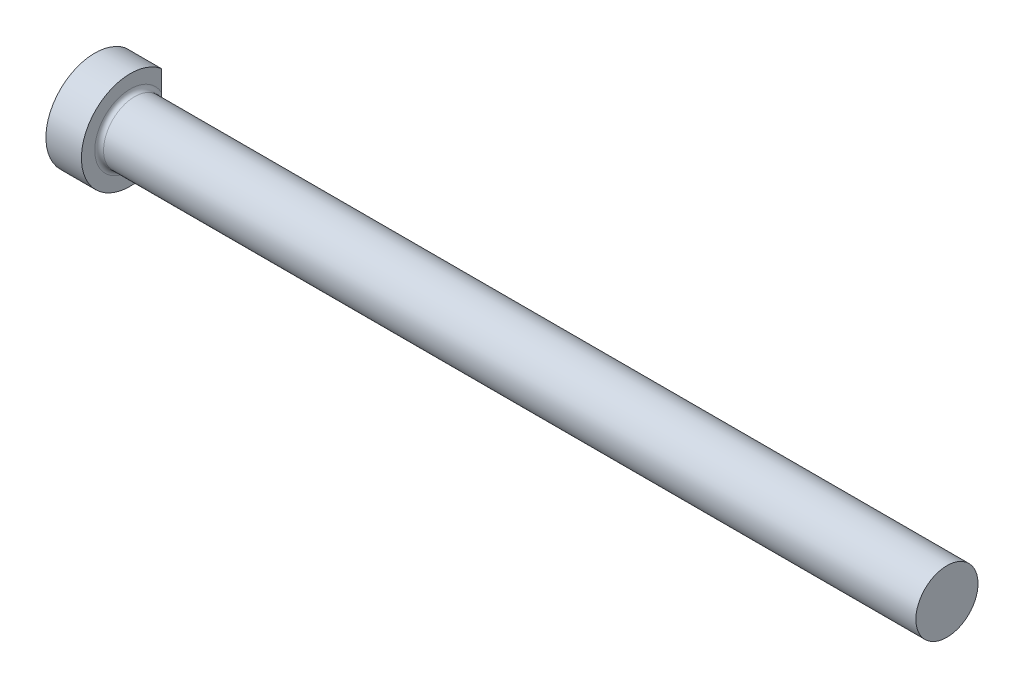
from build123d import *


with BuildPart() as part:
    # Sketch1 → PIN (revolve)
    with BuildSketch(Plane.XY, mode=Mode.PRIVATE) as pin_sk:
        with BuildLine():
            Line((0, 0), (0, 8.73125))
            Line((0, 8.73125), (6.35, 8.73125))
            Line((6.35, 8.73125), (6.35, 6.34365))
            ThreePointArc((6.35, 6.34365), (6.58062412, 5.78687412), (7.1374, 5.55625))
            Line((7.1374, 5.55625), (152.4, 5.55625))
            Line((152.4, 5.55625), (152.4, 0))
            Line((152.4, 0), (0, 0))
        make_face()
    revolve(pin_sk.sketch.rotate(Axis((152.4, 0, 0), (-1, 0, 0)), 180), axis=Axis((152.4, 0, 0), (-1, 0, 0)))

    # SurfaceCut1
    split(bisect_by=Plane(origin=(0, 0, -5.556504), x_dir=(-1, 0, 0), z_dir=(0, 0, -1)), keep=Keep.BOTTOM)


solid = part.part
